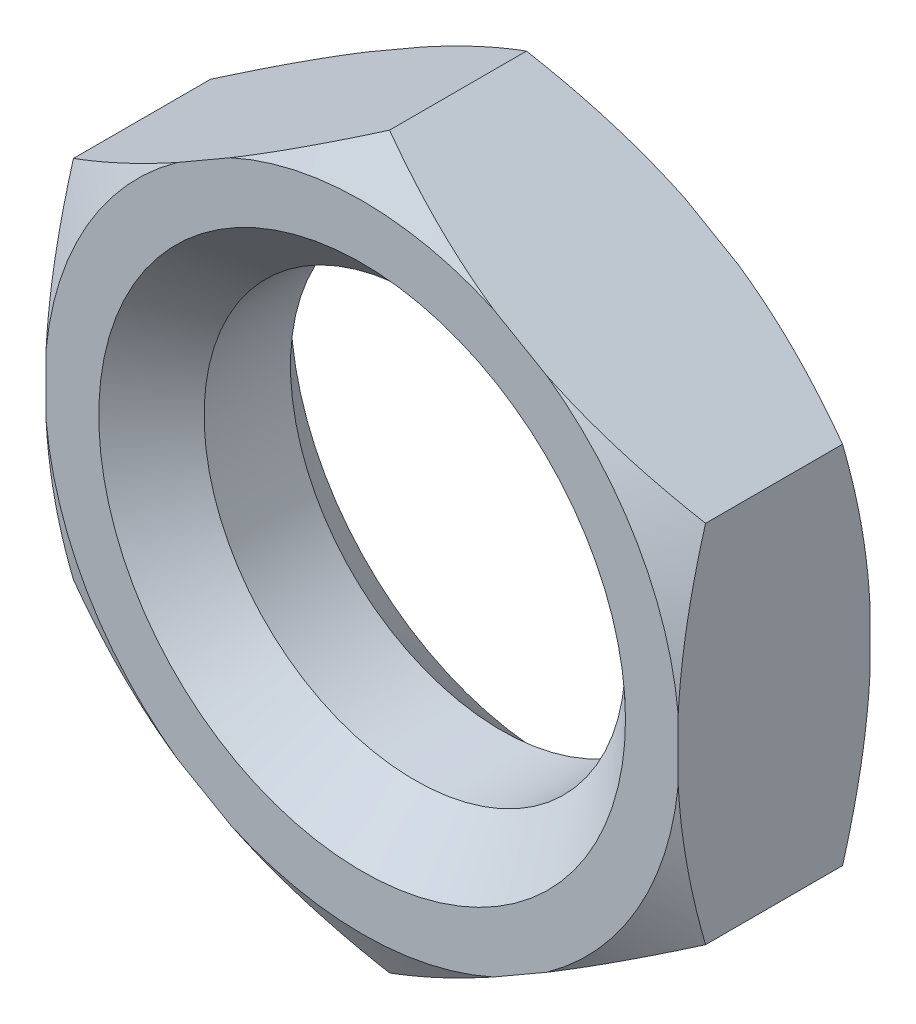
from build123d import *

# Parameters (mm, degrees)
BOSS_EXTRUDE1_DEPTH = 4.55
SKETCH6_R           = 10
CUT_EXTRUDE1_DEPTH  = 9.1
CHAMFER1_SIZE       = 2.5


with BuildPart() as part:
    # Sketch3 → Boss-Extrude1 (new, symmetric)
    with BuildSketch(Plane.XY):
        Polygon((0, 17.320508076), (-15, 8.660254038), (-15, -8.660254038), (0, -17.320508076), (15, -8.660254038), (15, 8.660254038), align=None)
    extrude(amount=BOSS_EXTRUDE1_DEPTH, both=True)

    # Sketch5 → Cut-Revolve1 (revolve, cut)
    with BuildSketch(Plane(origin=(0, 0, 0), x_dir=(0, 0, -1), z_dir=(1, 0, 0))):
        Polygon((-4.55, 17.320508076), (-4.55, 15.070508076), (-3.250961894, 17.320508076), align=None)
    cut_revolve1 = revolve(axis=Axis((0, 0, 5.457798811), (0, 0, -1)), mode=Mode.SUBTRACT)

    # Mirror1: Cut-Revolve1 across plane
    add(cut_revolve1.mirror(Plane.XY), mode=Mode.SUBTRACT)

    # Sketch6 → Cut-Extrude1 (cut)
    with BuildSketch(Plane.XY.offset(4.55)):
        Circle(SKETCH6_R)
    extrude(amount=-CUT_EXTRUDE1_DEPTH, mode=Mode.SUBTRACT)

    # Chamfer1
    chamfer1_edges = [part.edges().sort_by_distance(p)[0] for p in [
        (-10, 0, -4.55),
        (-10, 0, 4.55),
    ]]
    chamfer(chamfer1_edges, length=CHAMFER1_SIZE)


solid = part.part
